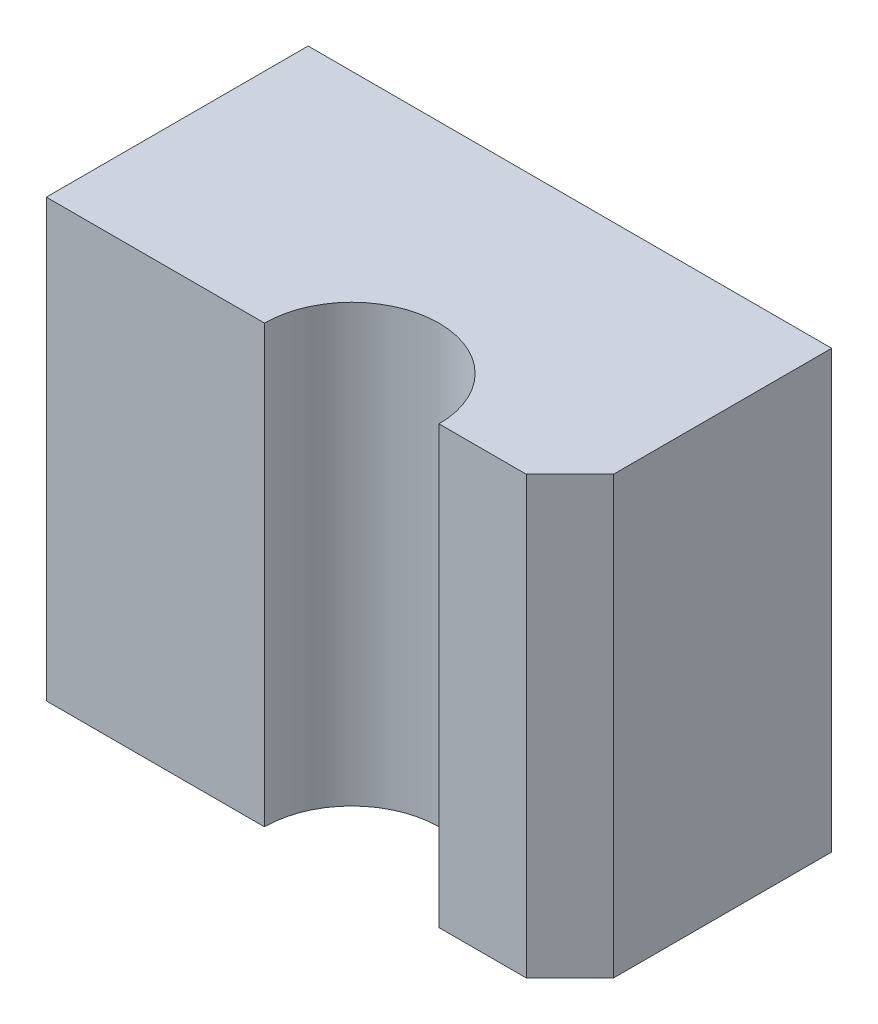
from build123d import *

# Parameters (mm, degrees)
SKETCH_2_W          = 120
SKETCH_2_H          = 100
EXTRUDE_1_DEPTH     = 60
SKETCH_3_R          = 20
CUT_EXTRUDE_1_DEPTH = 168.332005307
CHAMFER_1_SIZE      = 10


with BuildPart() as part:
    # Sketch 2 → Extrude 1 (new body)
    with BuildSketch(Plane.XY):
        with Locations((60, 50)):
            Rectangle(SKETCH_2_W, SKETCH_2_H)
    extrude(amount=EXTRUDE_1_DEPTH)

    # Sketch 3 → Cut-Extrude 1 (cut, through all)
    with BuildSketch(Plane.XZ):
        with Locations((70, 60)):
            Circle(SKETCH_3_R)
    extrude(amount=-CUT_EXTRUDE_1_DEPTH, mode=Mode.SUBTRACT)

    # Chamfer 1
    chamfer_1_edges = [part.edges().sort_by_distance(p)[0] for p in [
        (120, 50, 60),
    ]]
    chamfer(chamfer_1_edges, length=CHAMFER_1_SIZE)


solid = part.part
